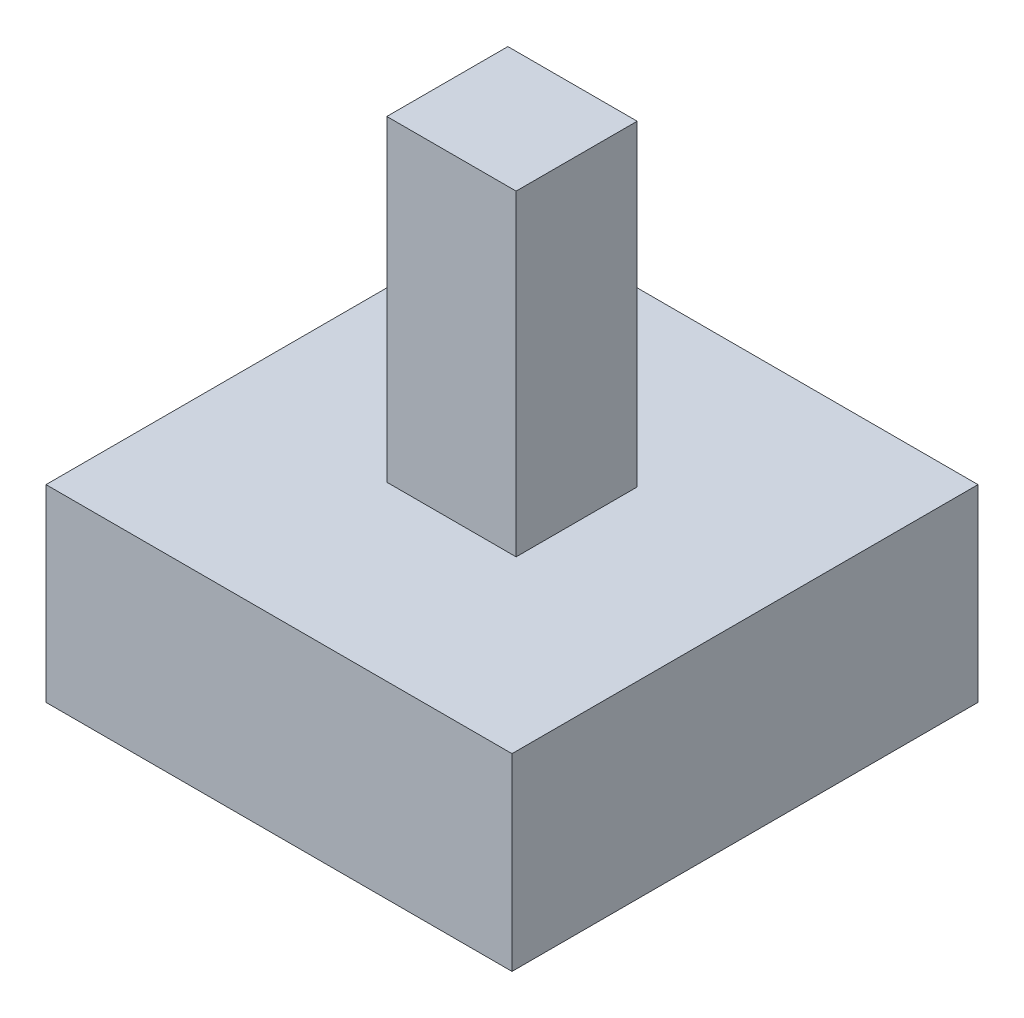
ISO-10303-21;
HEADER;
FILE_DESCRIPTION(('STEP AP214'),'2;1');
FILE_NAME('part.step','',(''),(''),'','','');
FILE_SCHEMA(('AUTOMOTIVE_DESIGN { 1 0 10303 214 1 1 1 1 }'));
ENDSEC;
DATA;
#1=APPLICATION_CONTEXT('core data for automotive mechanical design processes');
#2=APPLICATION_PROTOCOL_DEFINITION('international standard','automotive_design',2000,#1);
#3=PRODUCT_CONTEXT('',#1,'mechanical');
#4=PRODUCT('Part','Part','',(#3));
#5=PRODUCT_RELATED_PRODUCT_CATEGORY('part','',(#4));
#6=PRODUCT_DEFINITION_FORMATION('','',#4);
#7=PRODUCT_DEFINITION_CONTEXT('part definition',#1,'design');
#8=PRODUCT_DEFINITION('design','',#6,#7);
#9=PRODUCT_DEFINITION_SHAPE('','',#8);
#10=(LENGTH_UNIT() NAMED_UNIT(*) SI_UNIT(.MILLI.,.METRE.));
#11=(NAMED_UNIT(*) PLANE_ANGLE_UNIT() SI_UNIT($,.RADIAN.));
#12=(NAMED_UNIT(*) SI_UNIT($,.STERADIAN.) SOLID_ANGLE_UNIT());
#13=UNCERTAINTY_MEASURE_WITH_UNIT(LENGTH_MEASURE(1.E-05),#10,'distance_accuracy_value','');
#14=(GEOMETRIC_REPRESENTATION_CONTEXT(3) GLOBAL_UNCERTAINTY_ASSIGNED_CONTEXT((#13)) GLOBAL_UNIT_ASSIGNED_CONTEXT((#10,
#11,#12)) REPRESENTATION_CONTEXT('',''));
#15=CARTESIAN_POINT('',(0.,0.,0.));
#16=DIRECTION('',(0.,0.,1.));
#17=DIRECTION('',(1.,0.,0.));
#18=AXIS2_PLACEMENT_3D('',#15,#16,#17);
#19=CARTESIAN_POINT('',(-48.7636206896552,39.4736240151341,48.7636206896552));
#20=DIRECTION('',(0.,1.,0.));
#21=DIRECTION('',(0.,0.,1.));
#22=AXIS2_PLACEMENT_3D('',#19,#20,#21);
#23=PLANE('',#22);
#24=DIRECTION('',(0.,0.,1.));
#25=VECTOR('',#24,1.);
#26=CARTESIAN_POINT('',(-48.7636206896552,39.4736240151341,-48.7636206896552));
#27=LINE('',#26,#25);
#28=CARTESIAN_POINT('',(-48.7636206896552,39.4736240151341,-48.7636206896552));
#29=VERTEX_POINT('',#28);
#30=CARTESIAN_POINT('',(-48.7636206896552,39.4736240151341,48.7636206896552));
#31=VERTEX_POINT('',#30);
#32=EDGE_CURVE('E139',#29,#31,#27,.T.);
#33=ORIENTED_EDGE('',*,*,#32,.T.);
#34=DIRECTION('',(1.,0.,0.));
#35=VECTOR('',#34,1.);
#36=CARTESIAN_POINT('',(-48.7636206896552,39.4736240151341,48.7636206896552));
#37=LINE('',#36,#35);
#38=CARTESIAN_POINT('',(48.7636206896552,39.4736240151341,48.7636206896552));
#39=VERTEX_POINT('',#38);
#40=EDGE_CURVE('E84',#31,#39,#37,.T.);
#41=ORIENTED_EDGE('',*,*,#40,.T.);
#42=DIRECTION('',(0.,0.,-1.));
#43=VECTOR('',#42,1.);
#44=CARTESIAN_POINT('',(48.7636206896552,39.4736240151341,-48.7636206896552));
#45=LINE('',#44,#43);
#46=CARTESIAN_POINT('',(48.7636206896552,39.4736240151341,-48.7636206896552));
#47=VERTEX_POINT('',#46);
#48=EDGE_CURVE('E142',#39,#47,#45,.T.);
#49=ORIENTED_EDGE('',*,*,#48,.T.);
#50=DIRECTION('',(-1.,0.,0.));
#51=VECTOR('',#50,1.);
#52=CARTESIAN_POINT('',(-48.7636206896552,39.4736240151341,-48.7636206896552));
#53=LINE('',#52,#51);
#54=EDGE_CURVE('E56',#47,#29,#53,.T.);
#55=ORIENTED_EDGE('',*,*,#54,.T.);
#56=EDGE_LOOP('',(#33,#41,#49,#55));
#57=FACE_BOUND('',#56,.T.);
#58=DIRECTION('',(-1.,0.,0.));
#59=VECTOR('',#58,1.);
#60=CARTESIAN_POINT('',(13.5286218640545,39.4736240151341,-12.6671978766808));
#61=LINE('',#60,#59);
#62=CARTESIAN_POINT('',(13.5286218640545,39.4736240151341,-12.6671978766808));
#63=VERTEX_POINT('',#62);
#64=CARTESIAN_POINT('',(-13.5286218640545,39.4736240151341,-12.6671978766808));
#65=VERTEX_POINT('',#64);
#66=EDGE_CURVE('E262',#63,#65,#61,.T.);
#67=ORIENTED_EDGE('',*,*,#66,.F.);
#68=DIRECTION('',(0.,0.,-1.));
#69=VECTOR('',#68,1.);
#70=CARTESIAN_POINT('',(13.5286218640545,39.4736240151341,12.6671978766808));
#71=LINE('',#70,#69);
#72=CARTESIAN_POINT('',(13.5286218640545,39.4736240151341,12.6671978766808));
#73=VERTEX_POINT('',#72);
#74=EDGE_CURVE('E129',#73,#63,#71,.T.);
#75=ORIENTED_EDGE('',*,*,#74,.F.);
#76=DIRECTION('',(1.,0.,0.));
#77=VECTOR('',#76,1.);
#78=CARTESIAN_POINT('',(13.5286218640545,39.4736240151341,12.6671978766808));
#79=LINE('',#78,#77);
#80=CARTESIAN_POINT('',(-13.5286218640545,39.4736240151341,12.6671978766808));
#81=VERTEX_POINT('',#80);
#82=EDGE_CURVE('E125',#81,#73,#79,.T.);
#83=ORIENTED_EDGE('',*,*,#82,.F.);
#84=DIRECTION('',(0.,0.,1.));
#85=VECTOR('',#84,1.);
#86=CARTESIAN_POINT('',(-13.5286218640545,39.4736240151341,12.6671978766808));
#87=LINE('',#86,#85);
#88=EDGE_CURVE('E259',#65,#81,#87,.T.);
#89=ORIENTED_EDGE('',*,*,#88,.F.);
#90=EDGE_LOOP('',(#67,#75,#83,#89));
#91=FACE_BOUND('',#90,.T.);
#92=ADVANCED_FACE('F32',(#57,#91),#23,.T.);
#93=CARTESIAN_POINT('',(-48.7636206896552,39.4736240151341,-48.7636206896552));
#94=DIRECTION('',(1.,0.,0.));
#95=DIRECTION('',(0.,0.,-1.));
#96=AXIS2_PLACEMENT_3D('',#93,#94,#95);
#97=PLANE('',#96);
#98=DIRECTION('',(0.,0.,1.));
#99=VECTOR('',#98,1.);
#100=CARTESIAN_POINT('',(-48.7636206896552,0.,-48.7636206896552));
#101=LINE('',#100,#99);
#102=CARTESIAN_POINT('',(-48.7636206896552,0.,-48.7636206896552));
#103=VERTEX_POINT('',#102);
#104=CARTESIAN_POINT('',(-48.7636206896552,0.,48.7636206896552));
#105=VERTEX_POINT('',#104);
#106=EDGE_CURVE('E131',#103,#105,#101,.T.);
#107=ORIENTED_EDGE('',*,*,#106,.T.);
#108=DIRECTION('',(0.,-1.,0.));
#109=VECTOR('',#108,1.);
#110=CARTESIAN_POINT('',(-48.7636206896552,39.4736240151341,48.7636206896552));
#111=LINE('',#110,#109);
#112=EDGE_CURVE('E11',#31,#105,#111,.T.);
#113=ORIENTED_EDGE('',*,*,#112,.F.);
#114=ORIENTED_EDGE('',*,*,#32,.F.);
#115=DIRECTION('',(0.,-1.,0.));
#116=VECTOR('',#115,1.);
#117=CARTESIAN_POINT('',(-48.7636206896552,39.4736240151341,-48.7636206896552));
#118=LINE('',#117,#116);
#119=EDGE_CURVE('E144',#29,#103,#118,.T.);
#120=ORIENTED_EDGE('',*,*,#119,.T.);
#121=EDGE_LOOP('',(#107,#113,#114,#120));
#122=FACE_BOUND('',#121,.T.);
#123=ADVANCED_FACE('F34',(#122),#97,.F.);
#124=CARTESIAN_POINT('',(-48.7636206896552,39.4736240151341,48.7636206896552));
#125=DIRECTION('',(0.,0.,-1.));
#126=DIRECTION('',(-1.,0.,0.));
#127=AXIS2_PLACEMENT_3D('',#124,#125,#126);
#128=PLANE('',#127);
#129=DIRECTION('',(1.,0.,0.));
#130=VECTOR('',#129,1.);
#131=CARTESIAN_POINT('',(-48.7636206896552,0.,48.7636206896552));
#132=LINE('',#131,#130);
#133=CARTESIAN_POINT('',(48.7636206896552,0.,48.7636206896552));
#134=VERTEX_POINT('',#133);
#135=EDGE_CURVE('E134',#105,#134,#132,.T.);
#136=ORIENTED_EDGE('',*,*,#135,.T.);
#137=DIRECTION('',(0.,-1.,0.));
#138=VECTOR('',#137,1.);
#139=CARTESIAN_POINT('',(48.7636206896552,39.4736240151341,48.7636206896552));
#140=LINE('',#139,#138);
#141=EDGE_CURVE('E40',#39,#134,#140,.T.);
#142=ORIENTED_EDGE('',*,*,#141,.F.);
#143=ORIENTED_EDGE('',*,*,#40,.F.);
#144=ORIENTED_EDGE('',*,*,#112,.T.);
#145=EDGE_LOOP('',(#136,#142,#143,#144));
#146=FACE_BOUND('',#145,.T.);
#147=ADVANCED_FACE('F172',(#146),#128,.F.);
#148=CARTESIAN_POINT('',(48.7636206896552,39.4736240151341,-48.7636206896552));
#149=DIRECTION('',(-1.,0.,0.));
#150=DIRECTION('',(0.,0.,1.));
#151=AXIS2_PLACEMENT_3D('',#148,#149,#150);
#152=PLANE('',#151);
#153=DIRECTION('',(0.,0.,-1.));
#154=VECTOR('',#153,1.);
#155=CARTESIAN_POINT('',(48.7636206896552,0.,-48.7636206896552));
#156=LINE('',#155,#154);
#157=CARTESIAN_POINT('',(48.7636206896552,0.,-48.7636206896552));
#158=VERTEX_POINT('',#157);
#159=EDGE_CURVE('E147',#134,#158,#156,.T.);
#160=ORIENTED_EDGE('',*,*,#159,.T.);
#161=DIRECTION('',(0.,-1.,0.));
#162=VECTOR('',#161,1.);
#163=CARTESIAN_POINT('',(48.7636206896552,39.4736240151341,-48.7636206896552));
#164=LINE('',#163,#162);
#165=EDGE_CURVE('E151',#47,#158,#164,.T.);
#166=ORIENTED_EDGE('',*,*,#165,.F.);
#167=ORIENTED_EDGE('',*,*,#48,.F.);
#168=ORIENTED_EDGE('',*,*,#141,.T.);
#169=EDGE_LOOP('',(#160,#166,#167,#168));
#170=FACE_BOUND('',#169,.T.);
#171=ADVANCED_FACE('F156',(#170),#152,.F.);
#172=CARTESIAN_POINT('',(-48.7636206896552,39.4736240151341,-48.7636206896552));
#173=DIRECTION('',(0.,0.,1.));
#174=DIRECTION('',(1.,0.,0.));
#175=AXIS2_PLACEMENT_3D('',#172,#173,#174);
#176=PLANE('',#175);
#177=DIRECTION('',(-1.,0.,0.));
#178=VECTOR('',#177,1.);
#179=CARTESIAN_POINT('',(-48.7636206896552,0.,-48.7636206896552));
#180=LINE('',#179,#178);
#181=EDGE_CURVE('E77',#158,#103,#180,.T.);
#182=ORIENTED_EDGE('',*,*,#181,.T.);
#183=ORIENTED_EDGE('',*,*,#119,.F.);
#184=ORIENTED_EDGE('',*,*,#54,.F.);
#185=ORIENTED_EDGE('',*,*,#165,.T.);
#186=EDGE_LOOP('',(#182,#183,#184,#185));
#187=FACE_BOUND('',#186,.T.);
#188=ADVANCED_FACE('F164',(#187),#176,.F.);
#189=CARTESIAN_POINT('',(-48.7636206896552,0.,48.7636206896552));
#190=DIRECTION('',(0.,1.,0.));
#191=DIRECTION('',(0.,0.,1.));
#192=AXIS2_PLACEMENT_3D('',#189,#190,#191);
#193=PLANE('',#192);
#194=ORIENTED_EDGE('',*,*,#106,.F.);
#195=ORIENTED_EDGE('',*,*,#181,.F.);
#196=ORIENTED_EDGE('',*,*,#159,.F.);
#197=ORIENTED_EDGE('',*,*,#135,.F.);
#198=EDGE_LOOP('',(#194,#195,#196,#197));
#199=FACE_BOUND('',#198,.T.);
#200=ADVANCED_FACE('F160',(#199),#193,.F.);
#201=CARTESIAN_POINT('',(13.5286218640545,105.770097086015,12.6671978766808));
#202=DIRECTION('',(-1.,0.,0.));
#203=DIRECTION('',(0.,0.,1.));
#204=AXIS2_PLACEMENT_3D('',#201,#202,#203);
#205=PLANE('',#204);
#206=ORIENTED_EDGE('',*,*,#74,.T.);
#207=DIRECTION('',(0.,-1.,0.));
#208=VECTOR('',#207,1.);
#209=CARTESIAN_POINT('',(13.5286218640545,105.770097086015,-12.6671978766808));
#210=LINE('',#209,#208);
#211=CARTESIAN_POINT('',(13.5286218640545,105.770097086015,-12.6671978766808));
#212=VERTEX_POINT('',#211);
#213=EDGE_CURVE('E110',#212,#63,#210,.T.);
#214=ORIENTED_EDGE('',*,*,#213,.F.);
#215=DIRECTION('',(0.,0.,-1.));
#216=VECTOR('',#215,1.);
#217=CARTESIAN_POINT('',(13.5286218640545,105.770097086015,12.6671978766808));
#218=LINE('',#217,#216);
#219=CARTESIAN_POINT('',(13.5286218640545,105.770097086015,12.6671978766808));
#220=VERTEX_POINT('',#219);
#221=EDGE_CURVE('E117',#220,#212,#218,.T.);
#222=ORIENTED_EDGE('',*,*,#221,.F.);
#223=DIRECTION('',(0.,-1.,0.));
#224=VECTOR('',#223,1.);
#225=CARTESIAN_POINT('',(13.5286218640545,105.770097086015,12.6671978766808));
#226=LINE('',#225,#224);
#227=EDGE_CURVE('E257',#220,#73,#226,.T.);
#228=ORIENTED_EDGE('',*,*,#227,.T.);
#229=EDGE_LOOP('',(#206,#214,#222,#228));
#230=FACE_BOUND('',#229,.T.);
#231=ADVANCED_FACE('F127',(#230),#205,.F.);
#232=CARTESIAN_POINT('',(13.5286218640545,105.770097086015,-12.6671978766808));
#233=DIRECTION('',(0.,0.,1.));
#234=DIRECTION('',(1.,0.,0.));
#235=AXIS2_PLACEMENT_3D('',#232,#233,#234);
#236=PLANE('',#235);
#237=ORIENTED_EDGE('',*,*,#66,.T.);
#238=DIRECTION('',(0.,-1.,0.));
#239=VECTOR('',#238,1.);
#240=CARTESIAN_POINT('',(-13.5286218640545,105.770097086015,-12.6671978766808));
#241=LINE('',#240,#239);
#242=CARTESIAN_POINT('',(-13.5286218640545,105.770097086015,-12.6671978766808));
#243=VERTEX_POINT('',#242);
#244=EDGE_CURVE('E113',#243,#65,#241,.T.);
#245=ORIENTED_EDGE('',*,*,#244,.F.);
#246=DIRECTION('',(-1.,0.,0.));
#247=VECTOR('',#246,1.);
#248=CARTESIAN_POINT('',(13.5286218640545,105.770097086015,-12.6671978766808));
#249=LINE('',#248,#247);
#250=EDGE_CURVE('E106',#212,#243,#249,.T.);
#251=ORIENTED_EDGE('',*,*,#250,.F.);
#252=ORIENTED_EDGE('',*,*,#213,.T.);
#253=EDGE_LOOP('',(#237,#245,#251,#252));
#254=FACE_BOUND('',#253,.T.);
#255=ADVANCED_FACE('F108',(#254),#236,.F.);
#256=CARTESIAN_POINT('',(-13.5286218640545,105.770097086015,12.6671978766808));
#257=DIRECTION('',(1.,0.,0.));
#258=DIRECTION('',(0.,0.,-1.));
#259=AXIS2_PLACEMENT_3D('',#256,#257,#258);
#260=PLANE('',#259);
#261=ORIENTED_EDGE('',*,*,#88,.T.);
#262=DIRECTION('',(0.,-1.,0.));
#263=VECTOR('',#262,1.);
#264=CARTESIAN_POINT('',(-13.5286218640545,105.770097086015,12.6671978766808));
#265=LINE('',#264,#263);
#266=CARTESIAN_POINT('',(-13.5286218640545,105.770097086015,12.6671978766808));
#267=VERTEX_POINT('',#266);
#268=EDGE_CURVE('E47',#267,#81,#265,.T.);
#269=ORIENTED_EDGE('',*,*,#268,.F.);
#270=DIRECTION('',(0.,0.,1.));
#271=VECTOR('',#270,1.);
#272=CARTESIAN_POINT('',(-13.5286218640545,105.770097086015,12.6671978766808));
#273=LINE('',#272,#271);
#274=EDGE_CURVE('E116',#243,#267,#273,.T.);
#275=ORIENTED_EDGE('',*,*,#274,.F.);
#276=ORIENTED_EDGE('',*,*,#244,.T.);
#277=EDGE_LOOP('',(#261,#269,#275,#276));
#278=FACE_BOUND('',#277,.T.);
#279=ADVANCED_FACE('F185',(#278),#260,.F.);
#280=CARTESIAN_POINT('',(13.5286218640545,105.770097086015,12.6671978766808));
#281=DIRECTION('',(0.,0.,-1.));
#282=DIRECTION('',(-1.,0.,0.));
#283=AXIS2_PLACEMENT_3D('',#280,#281,#282);
#284=PLANE('',#283);
#285=ORIENTED_EDGE('',*,*,#82,.T.);
#286=ORIENTED_EDGE('',*,*,#227,.F.);
#287=DIRECTION('',(1.,0.,0.));
#288=VECTOR('',#287,1.);
#289=CARTESIAN_POINT('',(13.5286218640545,105.770097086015,12.6671978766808));
#290=LINE('',#289,#288);
#291=EDGE_CURVE('E121',#267,#220,#290,.T.);
#292=ORIENTED_EDGE('',*,*,#291,.F.);
#293=ORIENTED_EDGE('',*,*,#268,.T.);
#294=EDGE_LOOP('',(#285,#286,#292,#293));
#295=FACE_BOUND('',#294,.T.);
#296=ADVANCED_FACE('F188',(#295),#284,.F.);
#297=CARTESIAN_POINT('',(13.5286218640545,105.770097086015,-12.6671978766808));
#298=DIRECTION('',(0.,1.,0.));
#299=DIRECTION('',(0.,0.,1.));
#300=AXIS2_PLACEMENT_3D('',#297,#298,#299);
#301=PLANE('',#300);
#302=ORIENTED_EDGE('',*,*,#221,.T.);
#303=ORIENTED_EDGE('',*,*,#250,.T.);
#304=ORIENTED_EDGE('',*,*,#274,.T.);
#305=ORIENTED_EDGE('',*,*,#291,.T.);
#306=EDGE_LOOP('',(#302,#303,#304,#305));
#307=FACE_BOUND('',#306,.T.);
#308=ADVANCED_FACE('F120',(#307),#301,.T.);
#309=CLOSED_SHELL('',(#92,#123,#147,#171,#188,#200,#231,#255,#279,#296,#308));
#310=MANIFOLD_SOLID_BREP('B2',#309);
#311=ADVANCED_BREP_SHAPE_REPRESENTATION('',(#18,#310),#14);
#312=SHAPE_DEFINITION_REPRESENTATION(#9,#311);
ENDSEC;
END-ISO-10303-21;
